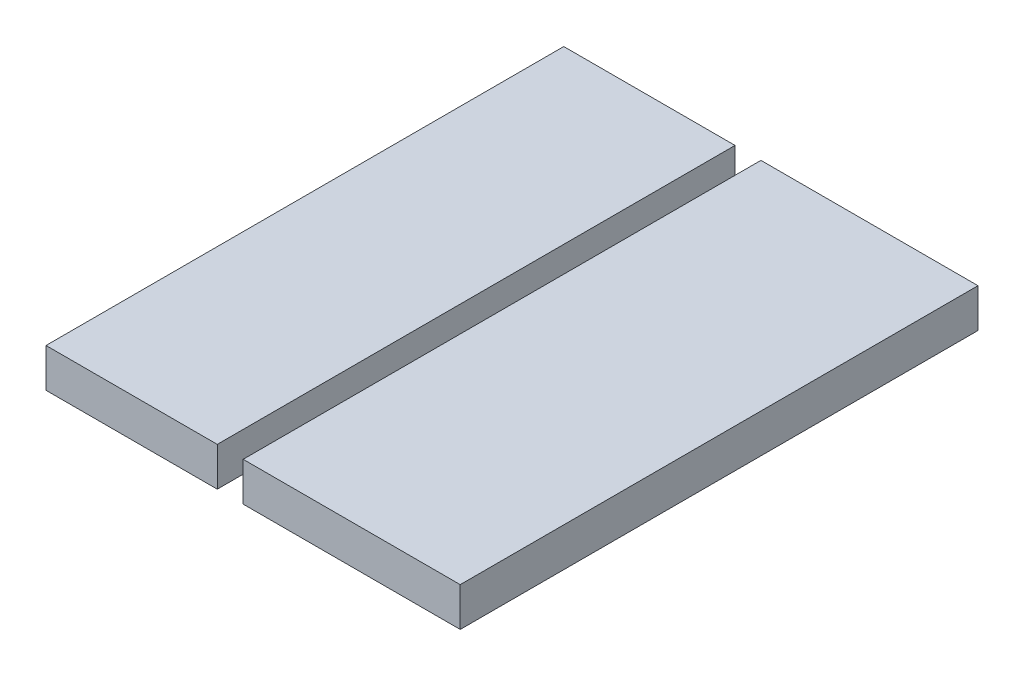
from build123d import *

# Parameters (mm, degrees)
SKETCH5_W           = 26.621064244
SKETCH5_H           = 63.5
BOSS_EXTRUDE2_DEPTH = 4.7625
SKETCH10_W          = 21.003935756
SKETCH10_H          = 63.5
BOSS_EXTRUDE3_DEPTH = 4.7625


with BuildPart() as part:
    # Sketch5 → Boss-Extrude2 (new body)
    with BuildSketch(Plane.XZ):
        with Locations((14.898032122, 8.645122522)):
            Rectangle(SKETCH5_W, SKETCH5_H)
    extrude(amount=-BOSS_EXTRUDE2_DEPTH)


with BuildPart() as body_2:
    # Sketch10 → Boss-Extrude3 (new body)
    with BuildSketch(Plane(origin=(0, 4.7625, 0), x_dir=(-1, 0, 0), z_dir=(0, 1, 0))):
        with Locations((12.089467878, 8.645122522)):
            Rectangle(SKETCH10_W, SKETCH10_H)
    extrude(amount=-BOSS_EXTRUDE3_DEPTH)


solid = Compound([part.part, body_2.part])
